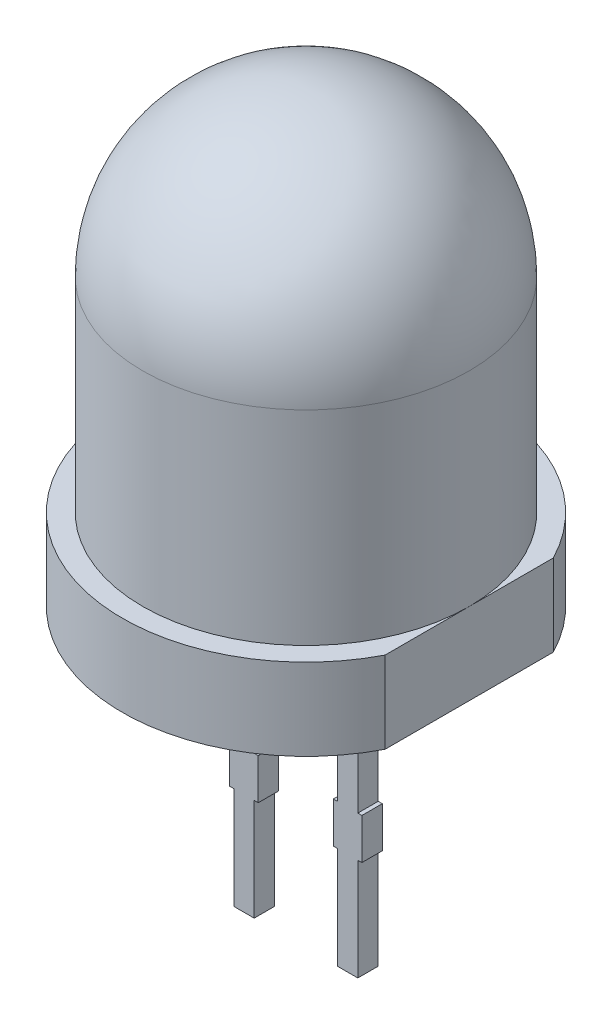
ISO-10303-21;
HEADER;
FILE_DESCRIPTION(('STEP AP214'),'2;1');
FILE_NAME('part.step','',(''),(''),'','','');
FILE_SCHEMA(('AUTOMOTIVE_DESIGN { 1 0 10303 214 1 1 1 1 }'));
ENDSEC;
DATA;
#1=APPLICATION_CONTEXT('core data for automotive mechanical design processes');
#2=APPLICATION_PROTOCOL_DEFINITION('international standard','automotive_design',2000,#1);
#3=PRODUCT_CONTEXT('',#1,'mechanical');
#4=PRODUCT('Part','Part','',(#3));
#5=PRODUCT_RELATED_PRODUCT_CATEGORY('part','',(#4));
#6=PRODUCT_DEFINITION_FORMATION('','',#4);
#7=PRODUCT_DEFINITION_CONTEXT('part definition',#1,'design');
#8=PRODUCT_DEFINITION('design','',#6,#7);
#9=PRODUCT_DEFINITION_SHAPE('','',#8);
#10=(LENGTH_UNIT() NAMED_UNIT(*) SI_UNIT(.MILLI.,.METRE.));
#11=(NAMED_UNIT(*) PLANE_ANGLE_UNIT() SI_UNIT($,.RADIAN.));
#12=(NAMED_UNIT(*) SI_UNIT($,.STERADIAN.) SOLID_ANGLE_UNIT());
#13=UNCERTAINTY_MEASURE_WITH_UNIT(LENGTH_MEASURE(1.E-05),#10,'distance_accuracy_value','');
#14=(GEOMETRIC_REPRESENTATION_CONTEXT(3) GLOBAL_UNCERTAINTY_ASSIGNED_CONTEXT((#13)) GLOBAL_UNIT_ASSIGNED_CONTEXT((#10,
#11,#12)) REPRESENTATION_CONTEXT('',''));
#15=CARTESIAN_POINT('',(0.,0.,0.));
#16=DIRECTION('',(0.,0.,1.));
#17=DIRECTION('',(1.,0.,0.));
#18=AXIS2_PLACEMENT_3D('',#15,#16,#17);
#19=CARTESIAN_POINT('',(4.5,4.5,0.));
#20=DIRECTION('',(0.,-1.,0.));
#21=DIRECTION('',(0.,0.,-1.));
#22=AXIS2_PLACEMENT_3D('',#19,#20,#21);
#23=PLANE('',#22);
#24=DIRECTION('',(-1.,0.,0.));
#25=VECTOR('',#24,1.);
#26=CARTESIAN_POINT('',(1.52,4.5,0.25));
#27=LINE('',#26,#25);
#28=CARTESIAN_POINT('',(1.52,4.5,0.25));
#29=VERTEX_POINT('',#28);
#30=CARTESIAN_POINT('',(1.02,4.5,0.25));
#31=VERTEX_POINT('',#30);
#32=EDGE_CURVE('E220',#29,#31,#27,.T.);
#33=ORIENTED_EDGE('',*,*,#32,.F.);
#34=DIRECTION('',(0.,0.,-1.));
#35=VECTOR('',#34,1.);
#36=CARTESIAN_POINT('',(1.52,4.5,0.25));
#37=LINE('',#36,#35);
#38=CARTESIAN_POINT('',(1.52,4.5,-0.25));
#39=VERTEX_POINT('',#38);
#40=EDGE_CURVE('E459',#29,#39,#37,.T.);
#41=ORIENTED_EDGE('',*,*,#40,.T.);
#42=DIRECTION('',(-1.,0.,0.));
#43=VECTOR('',#42,1.);
#44=CARTESIAN_POINT('',(1.52,4.5,-0.25));
#45=LINE('',#44,#43);
#46=CARTESIAN_POINT('',(1.02,4.5,-0.25));
#47=VERTEX_POINT('',#46);
#48=EDGE_CURVE('E235',#39,#47,#45,.T.);
#49=ORIENTED_EDGE('',*,*,#48,.T.);
#50=DIRECTION('',(0.,0.,-1.));
#51=VECTOR('',#50,1.);
#52=CARTESIAN_POINT('',(1.02,4.5,0.25));
#53=LINE('',#52,#51);
#54=EDGE_CURVE('E52',#31,#47,#53,.T.);
#55=ORIENTED_EDGE('',*,*,#54,.F.);
#56=EDGE_LOOP('',(#33,#41,#49,#55));
#57=FACE_BOUND('',#56,.T.);
#58=DIRECTION('',(0.,0.,1.));
#59=VECTOR('',#58,1.);
#60=CARTESIAN_POINT('',(4.,4.5,-2.06155281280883));
#61=LINE('',#60,#59);
#62=CARTESIAN_POINT('',(4.,4.5,-2.06155281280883));
#63=VERTEX_POINT('',#62);
#64=CARTESIAN_POINT('',(4.,4.5,2.06155281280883));
#65=VERTEX_POINT('',#64);
#66=EDGE_CURVE('E373',#63,#65,#61,.T.);
#67=ORIENTED_EDGE('',*,*,#66,.T.);
#68=CARTESIAN_POINT('',(0.,4.5,0.));
#69=DIRECTION('',(0.,-1.,0.));
#70=DIRECTION('',(0.,0.,-1.));
#71=AXIS2_PLACEMENT_3D('',#68,#69,#70);
#72=CIRCLE('',#71,4.5);
#73=EDGE_CURVE('E379',#65,#63,#72,.T.);
#74=ORIENTED_EDGE('',*,*,#73,.T.);
#75=EDGE_LOOP('',(#67,#74));
#76=FACE_BOUND('',#75,.T.);
#77=DIRECTION('',(0.,0.,-1.));
#78=VECTOR('',#77,1.);
#79=CARTESIAN_POINT('',(-1.52,4.5,0.25));
#80=LINE('',#79,#78);
#81=CARTESIAN_POINT('',(-1.52,4.5,0.25));
#82=VERTEX_POINT('',#81);
#83=CARTESIAN_POINT('',(-1.52,4.5,-0.25));
#84=VERTEX_POINT('',#83);
#85=EDGE_CURVE('E60',#82,#84,#80,.T.);
#86=ORIENTED_EDGE('',*,*,#85,.F.);
#87=DIRECTION('',(-1.,0.,0.));
#88=VECTOR('',#87,1.);
#89=CARTESIAN_POINT('',(-1.52,4.5,0.25));
#90=LINE('',#89,#88);
#91=CARTESIAN_POINT('',(-1.02,4.5,0.25));
#92=VERTEX_POINT('',#91);
#93=EDGE_CURVE('E248',#92,#82,#90,.T.);
#94=ORIENTED_EDGE('',*,*,#93,.F.);
#95=DIRECTION('',(0.,0.,-1.));
#96=VECTOR('',#95,1.);
#97=CARTESIAN_POINT('',(-1.02,4.5,0.25));
#98=LINE('',#97,#96);
#99=CARTESIAN_POINT('',(-1.02,4.5,-0.25));
#100=VERTEX_POINT('',#99);
#101=EDGE_CURVE('E286',#92,#100,#98,.T.);
#102=ORIENTED_EDGE('',*,*,#101,.T.);
#103=DIRECTION('',(-1.,0.,0.));
#104=VECTOR('',#103,1.);
#105=CARTESIAN_POINT('',(-1.52,4.5,-0.25));
#106=LINE('',#105,#104);
#107=EDGE_CURVE('E237',#100,#84,#106,.T.);
#108=ORIENTED_EDGE('',*,*,#107,.T.);
#109=EDGE_LOOP('',(#86,#94,#102,#108));
#110=FACE_BOUND('',#109,.T.);
#111=ADVANCED_FACE('F36',(#57,#76,#110),#23,.T.);
#112=CARTESIAN_POINT('',(0.,11.5,0.));
#113=DIRECTION('',(0.,-1.,0.));
#114=DIRECTION('',(1.,0.,0.));
#115=AXIS2_PLACEMENT_3D('',#112,#113,#114);
#116=SPHERICAL_SURFACE('',#115,4.);
#117=CARTESIAN_POINT('',(0.,11.5,0.));
#118=DIRECTION('',(0.,-1.,0.));
#119=DIRECTION('',(0.,0.,-1.));
#120=AXIS2_PLACEMENT_3D('',#117,#118,#119);
#121=CIRCLE('',#120,4.);
#122=CARTESIAN_POINT('',(0.,11.5,-4.));
#123=VERTEX_POINT('',#122);
#124=EDGE_CURVE('E11',#123,#123,#121,.T.);
#125=ORIENTED_EDGE('',*,*,#124,.F.);
#126=EDGE_LOOP('',(#125));
#127=FACE_BOUND('',#126,.T.);
#128=ADVANCED_FACE('F38',(#127),#116,.T.);
#129=CARTESIAN_POINT('',(0.,4.5,0.));
#130=DIRECTION('',(0.,-1.,0.));
#131=DIRECTION('',(0.,0.,-1.));
#132=AXIS2_PLACEMENT_3D('',#129,#130,#131);
#133=CYLINDRICAL_SURFACE('',#132,4.);
#134=ORIENTED_EDGE('',*,*,#124,.T.);
#135=EDGE_LOOP('',(#134));
#136=FACE_BOUND('',#135,.T.);
#137=CARTESIAN_POINT('',(0.,6.5,0.));
#138=DIRECTION('',(0.,-1.,0.));
#139=DIRECTION('',(0.,0.,-1.));
#140=AXIS2_PLACEMENT_3D('',#137,#138,#139);
#141=CIRCLE('',#140,4.);
#142=CARTESIAN_POINT('',(4.,6.5,0.));
#143=VERTEX_POINT('',#142);
#144=EDGE_CURVE('E45',#143,#143,#141,.T.);
#145=ORIENTED_EDGE('',*,*,#144,.F.);
#146=EDGE_LOOP('',(#145));
#147=FACE_BOUND('',#146,.T.);
#148=ADVANCED_FACE('F396',(#136,#147),#133,.T.);
#149=CARTESIAN_POINT('',(4.,6.5,0.));
#150=DIRECTION('',(0.,1.,0.));
#151=DIRECTION('',(0.,0.,1.));
#152=AXIS2_PLACEMENT_3D('',#149,#150,#151);
#153=PLANE('',#152);
#154=DIRECTION('',(0.,0.,1.));
#155=VECTOR('',#154,1.);
#156=CARTESIAN_POINT('',(4.,6.5,-2.06155281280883));
#157=LINE('',#156,#155);
#158=CARTESIAN_POINT('',(4.,6.5,-2.06155281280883));
#159=VERTEX_POINT('',#158);
#160=EDGE_CURVE('E365',#159,#143,#157,.T.);
#161=ORIENTED_EDGE('',*,*,#160,.F.);
#162=CARTESIAN_POINT('',(0.,6.5,0.));
#163=DIRECTION('',(0.,-1.,0.));
#164=DIRECTION('',(0.,0.,-1.));
#165=AXIS2_PLACEMENT_3D('',#162,#163,#164);
#166=CIRCLE('',#165,4.5);
#167=CARTESIAN_POINT('',(4.,6.5,2.06155281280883));
#168=VERTEX_POINT('',#167);
#169=EDGE_CURVE('E383',#168,#159,#166,.T.);
#170=ORIENTED_EDGE('',*,*,#169,.F.);
#171=EDGE_CURVE('E364',#143,#168,#157,.T.);
#172=ORIENTED_EDGE('',*,*,#171,.F.);
#173=ORIENTED_EDGE('',*,*,#144,.T.);
#174=EDGE_LOOP('',(#161,#170,#172,#173));
#175=FACE_BOUND('',#174,.T.);
#176=ADVANCED_FACE('F393',(#175),#153,.T.);
#177=CARTESIAN_POINT('',(0.,4.5,0.));
#178=DIRECTION('',(0.,-1.,0.));
#179=DIRECTION('',(0.,0.,-1.));
#180=AXIS2_PLACEMENT_3D('',#177,#178,#179);
#181=CYLINDRICAL_SURFACE('',#180,4.5);
#182=DIRECTION('',(0.,1.,0.));
#183=VECTOR('',#182,1.);
#184=CARTESIAN_POINT('',(4.,4.499,-2.06155281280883));
#185=LINE('',#184,#183);
#186=EDGE_CURVE('E368',#63,#159,#185,.T.);
#187=ORIENTED_EDGE('',*,*,#186,.F.);
#188=ORIENTED_EDGE('',*,*,#73,.F.);
#189=DIRECTION('',(0.,1.,0.));
#190=VECTOR('',#189,1.);
#191=CARTESIAN_POINT('',(4.,4.499,2.06155281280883));
#192=LINE('',#191,#190);
#193=EDGE_CURVE('E369',#65,#168,#192,.T.);
#194=ORIENTED_EDGE('',*,*,#193,.T.);
#195=ORIENTED_EDGE('',*,*,#169,.T.);
#196=EDGE_LOOP('',(#187,#188,#194,#195));
#197=FACE_BOUND('',#196,.T.);
#198=ADVANCED_FACE('F403',(#197),#181,.T.);
#199=CARTESIAN_POINT('',(4.,4.499,-2.06155281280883));
#200=DIRECTION('',(-1.,0.,0.));
#201=DIRECTION('',(0.,0.,1.));
#202=AXIS2_PLACEMENT_3D('',#199,#200,#201);
#203=PLANE('',#202);
#204=ORIENTED_EDGE('',*,*,#186,.T.);
#205=ORIENTED_EDGE('',*,*,#160,.T.);
#206=ORIENTED_EDGE('',*,*,#171,.T.);
#207=ORIENTED_EDGE('',*,*,#193,.F.);
#208=ORIENTED_EDGE('',*,*,#66,.F.);
#209=EDGE_LOOP('',(#204,#205,#206,#207,#208));
#210=FACE_BOUND('',#209,.T.);
#211=ADVANCED_FACE('F412',(#210),#203,.F.);
#212=CARTESIAN_POINT('',(-1.52,4.5,0.25));
#213=DIRECTION('',(1.,0.,0.));
#214=DIRECTION('',(0.,1.,0.));
#215=AXIS2_PLACEMENT_3D('',#212,#213,#214);
#216=PLANE('',#215);
#217=DIRECTION('',(0.,-1.,0.));
#218=VECTOR('',#217,1.);
#219=CARTESIAN_POINT('',(-1.52,4.5,-0.25));
#220=LINE('',#219,#218);
#221=CARTESIAN_POINT('',(-1.52,1.,-0.25));
#222=VERTEX_POINT('',#221);
#223=EDGE_CURVE('E241',#84,#222,#220,.T.);
#224=ORIENTED_EDGE('',*,*,#223,.T.);
#225=DIRECTION('',(0.,0.,-1.));
#226=VECTOR('',#225,1.);
#227=CARTESIAN_POINT('',(-1.52,1.,0.25));
#228=LINE('',#227,#226);
#229=CARTESIAN_POINT('',(-1.52,1.,0.25));
#230=VERTEX_POINT('',#229);
#231=EDGE_CURVE('E358',#230,#222,#228,.T.);
#232=ORIENTED_EDGE('',*,*,#231,.F.);
#233=DIRECTION('',(0.,-1.,0.));
#234=VECTOR('',#233,1.);
#235=CARTESIAN_POINT('',(-1.52,4.5,0.25));
#236=LINE('',#235,#234);
#237=EDGE_CURVE('E252',#82,#230,#236,.T.);
#238=ORIENTED_EDGE('',*,*,#237,.F.);
#239=ORIENTED_EDGE('',*,*,#85,.T.);
#240=EDGE_LOOP('',(#224,#232,#238,#239));
#241=FACE_BOUND('',#240,.T.);
#242=ADVANCED_FACE('F419',(#241),#216,.F.);
#243=CARTESIAN_POINT('',(-1.52,1.,0.25));
#244=DIRECTION('',(0.,-1.,0.));
#245=DIRECTION('',(0.,0.,-1.));
#246=AXIS2_PLACEMENT_3D('',#243,#244,#245);
#247=PLANE('',#246);
#248=DIRECTION('',(-1.,0.,0.));
#249=VECTOR('',#248,1.);
#250=CARTESIAN_POINT('',(-1.52,1.,-0.25));
#251=LINE('',#250,#249);
#252=CARTESIAN_POINT('',(-1.62,1.,-0.25));
#253=VERTEX_POINT('',#252);
#254=EDGE_CURVE('E290',#222,#253,#251,.T.);
#255=ORIENTED_EDGE('',*,*,#254,.T.);
#256=DIRECTION('',(0.,0.,-1.));
#257=VECTOR('',#256,1.);
#258=CARTESIAN_POINT('',(-1.62,1.,0.25));
#259=LINE('',#258,#257);
#260=CARTESIAN_POINT('',(-1.62,1.,0.25));
#261=VERTEX_POINT('',#260);
#262=EDGE_CURVE('E354',#261,#253,#259,.T.);
#263=ORIENTED_EDGE('',*,*,#262,.F.);
#264=DIRECTION('',(-1.,0.,0.));
#265=VECTOR('',#264,1.);
#266=CARTESIAN_POINT('',(-1.52,1.,0.25));
#267=LINE('',#266,#265);
#268=EDGE_CURVE('E256',#230,#261,#267,.T.);
#269=ORIENTED_EDGE('',*,*,#268,.F.);
#270=ORIENTED_EDGE('',*,*,#231,.T.);
#271=EDGE_LOOP('',(#255,#263,#269,#270));
#272=FACE_BOUND('',#271,.T.);
#273=ADVANCED_FACE('F630',(#272),#247,.F.);
#274=CARTESIAN_POINT('',(-1.62,1.,0.25));
#275=DIRECTION('',(1.,0.,0.));
#276=DIRECTION('',(0.,0.,-1.));
#277=AXIS2_PLACEMENT_3D('',#274,#275,#276);
#278=PLANE('',#277);
#279=DIRECTION('',(0.,-1.,0.));
#280=VECTOR('',#279,1.);
#281=CARTESIAN_POINT('',(-1.62,1.,-0.25));
#282=LINE('',#281,#280);
#283=CARTESIAN_POINT('',(-1.62,0.,-0.25));
#284=VERTEX_POINT('',#283);
#285=EDGE_CURVE('E293',#253,#284,#282,.T.);
#286=ORIENTED_EDGE('',*,*,#285,.T.);
#287=DIRECTION('',(0.,0.,-1.));
#288=VECTOR('',#287,1.);
#289=CARTESIAN_POINT('',(-1.62,0.,0.25));
#290=LINE('',#289,#288);
#291=CARTESIAN_POINT('',(-1.62,0.,0.25));
#292=VERTEX_POINT('',#291);
#293=EDGE_CURVE('E350',#292,#284,#290,.T.);
#294=ORIENTED_EDGE('',*,*,#293,.F.);
#295=DIRECTION('',(0.,-1.,0.));
#296=VECTOR('',#295,1.);
#297=CARTESIAN_POINT('',(-1.62,1.,0.25));
#298=LINE('',#297,#296);
#299=EDGE_CURVE('E259',#261,#292,#298,.T.);
#300=ORIENTED_EDGE('',*,*,#299,.F.);
#301=ORIENTED_EDGE('',*,*,#262,.T.);
#302=EDGE_LOOP('',(#286,#294,#300,#301));
#303=FACE_BOUND('',#302,.T.);
#304=ADVANCED_FACE('F626',(#303),#278,.F.);
#305=CARTESIAN_POINT('',(-1.62,0.,0.25));
#306=DIRECTION('',(0.,1.,0.));
#307=DIRECTION('',(0.,0.,1.));
#308=AXIS2_PLACEMENT_3D('',#305,#306,#307);
#309=PLANE('',#308);
#310=DIRECTION('',(1.,0.,0.));
#311=VECTOR('',#310,1.);
#312=CARTESIAN_POINT('',(-1.62,0.,-0.25));
#313=LINE('',#312,#311);
#314=CARTESIAN_POINT('',(-1.52,0.,-0.25));
#315=VERTEX_POINT('',#314);
#316=EDGE_CURVE('E296',#284,#315,#313,.T.);
#317=ORIENTED_EDGE('',*,*,#316,.T.);
#318=DIRECTION('',(0.,0.,-1.));
#319=VECTOR('',#318,1.);
#320=CARTESIAN_POINT('',(-1.52,0.,0.25));
#321=LINE('',#320,#319);
#322=CARTESIAN_POINT('',(-1.52,0.,0.25));
#323=VERTEX_POINT('',#322);
#324=EDGE_CURVE('E346',#323,#315,#321,.T.);
#325=ORIENTED_EDGE('',*,*,#324,.F.);
#326=DIRECTION('',(1.,0.,0.));
#327=VECTOR('',#326,1.);
#328=CARTESIAN_POINT('',(-1.62,0.,0.25));
#329=LINE('',#328,#327);
#330=EDGE_CURVE('E262',#292,#323,#329,.T.);
#331=ORIENTED_EDGE('',*,*,#330,.F.);
#332=ORIENTED_EDGE('',*,*,#293,.T.);
#333=EDGE_LOOP('',(#317,#325,#331,#332));
#334=FACE_BOUND('',#333,.T.);
#335=ADVANCED_FACE('F622',(#334),#309,.F.);
#336=CARTESIAN_POINT('',(-1.52,0.,0.25));
#337=DIRECTION('',(1.,0.,0.));
#338=DIRECTION('',(0.,0.,-1.));
#339=AXIS2_PLACEMENT_3D('',#336,#337,#338);
#340=PLANE('',#339);
#341=DIRECTION('',(0.,-1.,0.));
#342=VECTOR('',#341,1.);
#343=CARTESIAN_POINT('',(-1.52,0.,-0.25));
#344=LINE('',#343,#342);
#345=CARTESIAN_POINT('',(-1.52,-2.5,-0.25));
#346=VERTEX_POINT('',#345);
#347=EDGE_CURVE('E299',#315,#346,#344,.T.);
#348=ORIENTED_EDGE('',*,*,#347,.T.);
#349=DIRECTION('',(0.,0.,-1.));
#350=VECTOR('',#349,1.);
#351=CARTESIAN_POINT('',(-1.52,-2.5,0.25));
#352=LINE('',#351,#350);
#353=CARTESIAN_POINT('',(-1.52,-2.5,0.25));
#354=VERTEX_POINT('',#353);
#355=EDGE_CURVE('E342',#354,#346,#352,.T.);
#356=ORIENTED_EDGE('',*,*,#355,.F.);
#357=DIRECTION('',(0.,-1.,0.));
#358=VECTOR('',#357,1.);
#359=CARTESIAN_POINT('',(-1.52,0.,0.25));
#360=LINE('',#359,#358);
#361=EDGE_CURVE('E265',#323,#354,#360,.T.);
#362=ORIENTED_EDGE('',*,*,#361,.F.);
#363=ORIENTED_EDGE('',*,*,#324,.T.);
#364=EDGE_LOOP('',(#348,#356,#362,#363));
#365=FACE_BOUND('',#364,.T.);
#366=ADVANCED_FACE('F618',(#365),#340,.F.);
#367=CARTESIAN_POINT('',(-1.52,-2.5,0.25));
#368=DIRECTION('',(0.,1.,0.));
#369=DIRECTION('',(0.,0.,1.));
#370=AXIS2_PLACEMENT_3D('',#367,#368,#369);
#371=PLANE('',#370);
#372=DIRECTION('',(1.,0.,0.));
#373=VECTOR('',#372,1.);
#374=CARTESIAN_POINT('',(-1.52,-2.5,-0.25));
#375=LINE('',#374,#373);
#376=CARTESIAN_POINT('',(-1.02,-2.5,-0.25));
#377=VERTEX_POINT('',#376);
#378=EDGE_CURVE('E302',#346,#377,#375,.T.);
#379=ORIENTED_EDGE('',*,*,#378,.T.);
#380=DIRECTION('',(0.,0.,-1.));
#381=VECTOR('',#380,1.);
#382=CARTESIAN_POINT('',(-1.02,-2.5,0.25));
#383=LINE('',#382,#381);
#384=CARTESIAN_POINT('',(-1.02,-2.5,0.25));
#385=VERTEX_POINT('',#384);
#386=EDGE_CURVE('E338',#385,#377,#383,.T.);
#387=ORIENTED_EDGE('',*,*,#386,.F.);
#388=DIRECTION('',(1.,0.,0.));
#389=VECTOR('',#388,1.);
#390=CARTESIAN_POINT('',(-1.52,-2.5,0.25));
#391=LINE('',#390,#389);
#392=EDGE_CURVE('E268',#354,#385,#391,.T.);
#393=ORIENTED_EDGE('',*,*,#392,.F.);
#394=ORIENTED_EDGE('',*,*,#355,.T.);
#395=EDGE_LOOP('',(#379,#387,#393,#394));
#396=FACE_BOUND('',#395,.T.);
#397=ADVANCED_FACE('F614',(#396),#371,.F.);
#398=CARTESIAN_POINT('',(-1.02,0.,0.25));
#399=DIRECTION('',(-1.,0.,0.));
#400=DIRECTION('',(0.,-1.,0.));
#401=AXIS2_PLACEMENT_3D('',#398,#399,#400);
#402=PLANE('',#401);
#403=DIRECTION('',(0.,1.,0.));
#404=VECTOR('',#403,1.);
#405=CARTESIAN_POINT('',(-1.02,0.,-0.25));
#406=LINE('',#405,#404);
#407=CARTESIAN_POINT('',(-1.02,0.,-0.25));
#408=VERTEX_POINT('',#407);
#409=EDGE_CURVE('E305',#377,#408,#406,.T.);
#410=ORIENTED_EDGE('',*,*,#409,.T.);
#411=DIRECTION('',(0.,0.,-1.));
#412=VECTOR('',#411,1.);
#413=CARTESIAN_POINT('',(-1.02,0.,0.25));
#414=LINE('',#413,#412);
#415=CARTESIAN_POINT('',(-1.02,0.,0.25));
#416=VERTEX_POINT('',#415);
#417=EDGE_CURVE('E334',#416,#408,#414,.T.);
#418=ORIENTED_EDGE('',*,*,#417,.F.);
#419=DIRECTION('',(0.,1.,0.));
#420=VECTOR('',#419,1.);
#421=CARTESIAN_POINT('',(-1.02,0.,0.25));
#422=LINE('',#421,#420);
#423=EDGE_CURVE('E271',#385,#416,#422,.T.);
#424=ORIENTED_EDGE('',*,*,#423,.F.);
#425=ORIENTED_EDGE('',*,*,#386,.T.);
#426=EDGE_LOOP('',(#410,#418,#424,#425));
#427=FACE_BOUND('',#426,.T.);
#428=ADVANCED_FACE('F610',(#427),#402,.F.);
#429=CARTESIAN_POINT('',(-0.919999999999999,0.,0.25));
#430=DIRECTION('',(0.,1.,0.));
#431=DIRECTION('',(-1.,0.,0.));
#432=AXIS2_PLACEMENT_3D('',#429,#430,#431);
#433=PLANE('',#432);
#434=DIRECTION('',(1.,0.,0.));
#435=VECTOR('',#434,1.);
#436=CARTESIAN_POINT('',(-0.919999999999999,0.,-0.25));
#437=LINE('',#436,#435);
#438=CARTESIAN_POINT('',(-0.919999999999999,0.,-0.25));
#439=VERTEX_POINT('',#438);
#440=EDGE_CURVE('E308',#408,#439,#437,.T.);
#441=ORIENTED_EDGE('',*,*,#440,.T.);
#442=DIRECTION('',(0.,0.,-1.));
#443=VECTOR('',#442,1.);
#444=CARTESIAN_POINT('',(-0.919999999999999,0.,0.25));
#445=LINE('',#444,#443);
#446=CARTESIAN_POINT('',(-0.919999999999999,0.,0.25));
#447=VERTEX_POINT('',#446);
#448=EDGE_CURVE('E330',#447,#439,#445,.T.);
#449=ORIENTED_EDGE('',*,*,#448,.F.);
#450=DIRECTION('',(1.,0.,0.));
#451=VECTOR('',#450,1.);
#452=CARTESIAN_POINT('',(-0.919999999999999,0.,0.25));
#453=LINE('',#452,#451);
#454=EDGE_CURVE('E274',#416,#447,#453,.T.);
#455=ORIENTED_EDGE('',*,*,#454,.F.);
#456=ORIENTED_EDGE('',*,*,#417,.T.);
#457=EDGE_LOOP('',(#441,#449,#455,#456));
#458=FACE_BOUND('',#457,.T.);
#459=ADVANCED_FACE('F606',(#458),#433,.F.);
#460=CARTESIAN_POINT('',(-0.920000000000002,1.,0.25));
#461=DIRECTION('',(-1.,0.,0.));
#462=DIRECTION('',(0.,-1.,0.));
#463=AXIS2_PLACEMENT_3D('',#460,#461,#462);
#464=PLANE('',#463);
#465=DIRECTION('',(0.,1.,0.));
#466=VECTOR('',#465,1.);
#467=CARTESIAN_POINT('',(-0.920000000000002,1.,-0.25));
#468=LINE('',#467,#466);
#469=CARTESIAN_POINT('',(-0.920000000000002,1.,-0.25));
#470=VERTEX_POINT('',#469);
#471=EDGE_CURVE('E311',#439,#470,#468,.T.);
#472=ORIENTED_EDGE('',*,*,#471,.T.);
#473=DIRECTION('',(0.,0.,-1.));
#474=VECTOR('',#473,1.);
#475=CARTESIAN_POINT('',(-0.920000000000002,1.,0.25));
#476=LINE('',#475,#474);
#477=CARTESIAN_POINT('',(-0.920000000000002,1.,0.25));
#478=VERTEX_POINT('',#477);
#479=EDGE_CURVE('E326',#478,#470,#476,.T.);
#480=ORIENTED_EDGE('',*,*,#479,.F.);
#481=DIRECTION('',(0.,1.,0.));
#482=VECTOR('',#481,1.);
#483=CARTESIAN_POINT('',(-0.920000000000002,1.,0.25));
#484=LINE('',#483,#482);
#485=EDGE_CURVE('E277',#447,#478,#484,.T.);
#486=ORIENTED_EDGE('',*,*,#485,.F.);
#487=ORIENTED_EDGE('',*,*,#448,.T.);
#488=EDGE_LOOP('',(#472,#480,#486,#487));
#489=FACE_BOUND('',#488,.T.);
#490=ADVANCED_FACE('F602',(#489),#464,.F.);
#491=CARTESIAN_POINT('',(-1.02,1.,0.25));
#492=DIRECTION('',(0.,-1.,0.));
#493=DIRECTION('',(0.,0.,-1.));
#494=AXIS2_PLACEMENT_3D('',#491,#492,#493);
#495=PLANE('',#494);
#496=DIRECTION('',(-1.,0.,0.));
#497=VECTOR('',#496,1.);
#498=CARTESIAN_POINT('',(-1.02,1.,-0.25));
#499=LINE('',#498,#497);
#500=CARTESIAN_POINT('',(-1.02,1.,-0.25));
#501=VERTEX_POINT('',#500);
#502=EDGE_CURVE('E314',#470,#501,#499,.T.);
#503=ORIENTED_EDGE('',*,*,#502,.T.);
#504=DIRECTION('',(0.,0.,-1.));
#505=VECTOR('',#504,1.);
#506=CARTESIAN_POINT('',(-1.02,1.,0.25));
#507=LINE('',#506,#505);
#508=CARTESIAN_POINT('',(-1.02,1.,0.25));
#509=VERTEX_POINT('',#508);
#510=EDGE_CURVE('E322',#509,#501,#507,.T.);
#511=ORIENTED_EDGE('',*,*,#510,.F.);
#512=DIRECTION('',(-1.,0.,0.));
#513=VECTOR('',#512,1.);
#514=CARTESIAN_POINT('',(-1.02,1.,0.25));
#515=LINE('',#514,#513);
#516=EDGE_CURVE('E280',#478,#509,#515,.T.);
#517=ORIENTED_EDGE('',*,*,#516,.F.);
#518=ORIENTED_EDGE('',*,*,#479,.T.);
#519=EDGE_LOOP('',(#503,#511,#517,#518));
#520=FACE_BOUND('',#519,.T.);
#521=ADVANCED_FACE('F598',(#520),#495,.F.);
#522=CARTESIAN_POINT('',(-1.02,4.5,0.25));
#523=DIRECTION('',(-1.,0.,0.));
#524=DIRECTION('',(0.,-1.,0.));
#525=AXIS2_PLACEMENT_3D('',#522,#523,#524);
#526=PLANE('',#525);
#527=DIRECTION('',(0.,1.,0.));
#528=VECTOR('',#527,1.);
#529=CARTESIAN_POINT('',(-1.02,4.5,-0.25));
#530=LINE('',#529,#528);
#531=EDGE_CURVE('E253',#501,#100,#530,.T.);
#532=ORIENTED_EDGE('',*,*,#531,.T.);
#533=ORIENTED_EDGE('',*,*,#101,.F.);
#534=DIRECTION('',(0.,1.,0.));
#535=VECTOR('',#534,1.);
#536=CARTESIAN_POINT('',(-1.02,4.5,0.25));
#537=LINE('',#536,#535);
#538=EDGE_CURVE('E283',#509,#92,#537,.T.);
#539=ORIENTED_EDGE('',*,*,#538,.F.);
#540=ORIENTED_EDGE('',*,*,#510,.T.);
#541=EDGE_LOOP('',(#532,#533,#539,#540));
#542=FACE_BOUND('',#541,.T.);
#543=ADVANCED_FACE('F591',(#542),#526,.F.);
#544=CARTESIAN_POINT('',(-1.52,4.5,0.25));
#545=DIRECTION('',(0.,0.,-1.));
#546=DIRECTION('',(-1.,0.,0.));
#547=AXIS2_PLACEMENT_3D('',#544,#545,#546);
#548=PLANE('',#547);
#549=ORIENTED_EDGE('',*,*,#93,.T.);
#550=ORIENTED_EDGE('',*,*,#237,.T.);
#551=ORIENTED_EDGE('',*,*,#268,.T.);
#552=ORIENTED_EDGE('',*,*,#299,.T.);
#553=ORIENTED_EDGE('',*,*,#330,.T.);
#554=ORIENTED_EDGE('',*,*,#361,.T.);
#555=ORIENTED_EDGE('',*,*,#392,.T.);
#556=ORIENTED_EDGE('',*,*,#423,.T.);
#557=ORIENTED_EDGE('',*,*,#454,.T.);
#558=ORIENTED_EDGE('',*,*,#485,.T.);
#559=ORIENTED_EDGE('',*,*,#516,.T.);
#560=ORIENTED_EDGE('',*,*,#538,.T.);
#561=EDGE_LOOP('',(#549,#550,#551,#552,#553,#554,#555,#556,#557,#558,#559,#560));
#562=FACE_BOUND('',#561,.T.);
#563=ADVANCED_FACE('F588',(#562),#548,.F.);
#564=CARTESIAN_POINT('',(-1.52,4.5,-0.25));
#565=DIRECTION('',(0.,0.,-1.));
#566=DIRECTION('',(-1.,0.,0.));
#567=AXIS2_PLACEMENT_3D('',#564,#565,#566);
#568=PLANE('',#567);
#569=ORIENTED_EDGE('',*,*,#107,.F.);
#570=ORIENTED_EDGE('',*,*,#531,.F.);
#571=ORIENTED_EDGE('',*,*,#502,.F.);
#572=ORIENTED_EDGE('',*,*,#471,.F.);
#573=ORIENTED_EDGE('',*,*,#440,.F.);
#574=ORIENTED_EDGE('',*,*,#409,.F.);
#575=ORIENTED_EDGE('',*,*,#378,.F.);
#576=ORIENTED_EDGE('',*,*,#347,.F.);
#577=ORIENTED_EDGE('',*,*,#316,.F.);
#578=ORIENTED_EDGE('',*,*,#285,.F.);
#579=ORIENTED_EDGE('',*,*,#254,.F.);
#580=ORIENTED_EDGE('',*,*,#223,.F.);
#581=EDGE_LOOP('',(#569,#570,#571,#572,#573,#574,#575,#576,#577,#578,#579,#580));
#582=FACE_BOUND('',#581,.T.);
#583=ADVANCED_FACE('F587',(#582),#568,.T.);
#584=CARTESIAN_POINT('',(1.02,4.5,0.25));
#585=DIRECTION('',(1.,0.,0.));
#586=DIRECTION('',(0.,1.,0.));
#587=AXIS2_PLACEMENT_3D('',#584,#585,#586);
#588=PLANE('',#587);
#589=DIRECTION('',(0.,-1.,0.));
#590=VECTOR('',#589,1.);
#591=CARTESIAN_POINT('',(1.02,4.5,-0.25));
#592=LINE('',#591,#590);
#593=CARTESIAN_POINT('',(1.02,1.,-0.25));
#594=VERTEX_POINT('',#593);
#595=EDGE_CURVE('E436',#47,#594,#592,.T.);
#596=ORIENTED_EDGE('',*,*,#595,.T.);
#597=DIRECTION('',(0.,0.,-1.));
#598=VECTOR('',#597,1.);
#599=CARTESIAN_POINT('',(1.02,1.,0.25));
#600=LINE('',#599,#598);
#601=CARTESIAN_POINT('',(1.02,1.,0.25));
#602=VERTEX_POINT('',#601);
#603=EDGE_CURVE('E215',#602,#594,#600,.T.);
#604=ORIENTED_EDGE('',*,*,#603,.F.);
#605=DIRECTION('',(0.,-1.,0.));
#606=VECTOR('',#605,1.);
#607=CARTESIAN_POINT('',(1.02,4.5,0.25));
#608=LINE('',#607,#606);
#609=EDGE_CURVE('E211',#31,#602,#608,.T.);
#610=ORIENTED_EDGE('',*,*,#609,.F.);
#611=ORIENTED_EDGE('',*,*,#54,.T.);
#612=EDGE_LOOP('',(#596,#604,#610,#611));
#613=FACE_BOUND('',#612,.T.);
#614=ADVANCED_FACE('F213',(#613),#588,.F.);
#615=CARTESIAN_POINT('',(1.02,1.,0.25));
#616=DIRECTION('',(0.,-1.,0.));
#617=DIRECTION('',(0.,0.,-1.));
#618=AXIS2_PLACEMENT_3D('',#615,#616,#617);
#619=PLANE('',#618);
#620=DIRECTION('',(-1.,0.,0.));
#621=VECTOR('',#620,1.);
#622=CARTESIAN_POINT('',(1.02,1.,-0.25));
#623=LINE('',#622,#621);
#624=CARTESIAN_POINT('',(0.920000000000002,1.,-0.25));
#625=VERTEX_POINT('',#624);
#626=EDGE_CURVE('E448',#594,#625,#623,.T.);
#627=ORIENTED_EDGE('',*,*,#626,.T.);
#628=DIRECTION('',(0.,0.,-1.));
#629=VECTOR('',#628,1.);
#630=CARTESIAN_POINT('',(0.920000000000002,1.,0.25));
#631=LINE('',#630,#629);
#632=CARTESIAN_POINT('',(0.920000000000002,1.,0.25));
#633=VERTEX_POINT('',#632);
#634=EDGE_CURVE('E244',#633,#625,#631,.T.);
#635=ORIENTED_EDGE('',*,*,#634,.F.);
#636=DIRECTION('',(-1.,0.,0.));
#637=VECTOR('',#636,1.);
#638=CARTESIAN_POINT('',(1.02,1.,0.25));
#639=LINE('',#638,#637);
#640=EDGE_CURVE('E219',#602,#633,#639,.T.);
#641=ORIENTED_EDGE('',*,*,#640,.F.);
#642=ORIENTED_EDGE('',*,*,#603,.T.);
#643=EDGE_LOOP('',(#627,#635,#641,#642));
#644=FACE_BOUND('',#643,.T.);
#645=ADVANCED_FACE('F581',(#644),#619,.F.);
#646=CARTESIAN_POINT('',(0.920000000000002,1.,0.25));
#647=DIRECTION('',(1.,0.,0.));
#648=DIRECTION('',(0.,1.,0.));
#649=AXIS2_PLACEMENT_3D('',#646,#647,#648);
#650=PLANE('',#649);
#651=DIRECTION('',(0.,-1.,0.));
#652=VECTOR('',#651,1.);
#653=CARTESIAN_POINT('',(0.920000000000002,1.,-0.25));
#654=LINE('',#653,#652);
#655=CARTESIAN_POINT('',(0.919999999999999,0.,-0.25));
#656=VERTEX_POINT('',#655);
#657=EDGE_CURVE('E441',#625,#656,#654,.T.);
#658=ORIENTED_EDGE('',*,*,#657,.T.);
#659=DIRECTION('',(0.,0.,-1.));
#660=VECTOR('',#659,1.);
#661=CARTESIAN_POINT('',(0.919999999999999,0.,0.25));
#662=LINE('',#661,#660);
#663=CARTESIAN_POINT('',(0.919999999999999,0.,0.25));
#664=VERTEX_POINT('',#663);
#665=EDGE_CURVE('E426',#664,#656,#662,.T.);
#666=ORIENTED_EDGE('',*,*,#665,.F.);
#667=DIRECTION('',(0.,-1.,0.));
#668=VECTOR('',#667,1.);
#669=CARTESIAN_POINT('',(0.920000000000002,1.,0.25));
#670=LINE('',#669,#668);
#671=EDGE_CURVE('E462',#633,#664,#670,.T.);
#672=ORIENTED_EDGE('',*,*,#671,.F.);
#673=ORIENTED_EDGE('',*,*,#634,.T.);
#674=EDGE_LOOP('',(#658,#666,#672,#673));
#675=FACE_BOUND('',#674,.T.);
#676=ADVANCED_FACE('F541',(#675),#650,.F.);
#677=CARTESIAN_POINT('',(0.919999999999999,0.,0.25));
#678=DIRECTION('',(0.,1.,0.));
#679=DIRECTION('',(-1.,0.,0.));
#680=AXIS2_PLACEMENT_3D('',#677,#678,#679);
#681=PLANE('',#680);
#682=DIRECTION('',(1.,0.,0.));
#683=VECTOR('',#682,1.);
#684=CARTESIAN_POINT('',(0.919999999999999,0.,-0.25));
#685=LINE('',#684,#683);
#686=CARTESIAN_POINT('',(1.02,0.,-0.25));
#687=VERTEX_POINT('',#686);
#688=EDGE_CURVE('E439',#656,#687,#685,.T.);
#689=ORIENTED_EDGE('',*,*,#688,.T.);
#690=DIRECTION('',(0.,0.,-1.));
#691=VECTOR('',#690,1.);
#692=CARTESIAN_POINT('',(1.02,0.,0.25));
#693=LINE('',#692,#691);
#694=CARTESIAN_POINT('',(1.02,0.,0.25));
#695=VERTEX_POINT('',#694);
#696=EDGE_CURVE('E479',#695,#687,#693,.T.);
#697=ORIENTED_EDGE('',*,*,#696,.F.);
#698=DIRECTION('',(1.,0.,0.));
#699=VECTOR('',#698,1.);
#700=CARTESIAN_POINT('',(0.919999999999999,0.,0.25));
#701=LINE('',#700,#699);
#702=EDGE_CURVE('E457',#664,#695,#701,.T.);
#703=ORIENTED_EDGE('',*,*,#702,.F.);
#704=ORIENTED_EDGE('',*,*,#665,.T.);
#705=EDGE_LOOP('',(#689,#697,#703,#704));
#706=FACE_BOUND('',#705,.T.);
#707=ADVANCED_FACE('F544',(#706),#681,.F.);
#708=CARTESIAN_POINT('',(1.02,0.,0.25));
#709=DIRECTION('',(1.,0.,0.));
#710=DIRECTION('',(0.,1.,0.));
#711=AXIS2_PLACEMENT_3D('',#708,#709,#710);
#712=PLANE('',#711);
#713=DIRECTION('',(0.,-1.,0.));
#714=VECTOR('',#713,1.);
#715=CARTESIAN_POINT('',(1.02,0.,-0.25));
#716=LINE('',#715,#714);
#717=CARTESIAN_POINT('',(1.02,-2.5,-0.25));
#718=VERTEX_POINT('',#717);
#719=EDGE_CURVE('E434',#687,#718,#716,.T.);
#720=ORIENTED_EDGE('',*,*,#719,.T.);
#721=DIRECTION('',(0.,0.,-1.));
#722=VECTOR('',#721,1.);
#723=CARTESIAN_POINT('',(1.02,-2.5,0.25));
#724=LINE('',#723,#722);
#725=CARTESIAN_POINT('',(1.02,-2.5,0.25));
#726=VERTEX_POINT('',#725);
#727=EDGE_CURVE('E476',#726,#718,#724,.T.);
#728=ORIENTED_EDGE('',*,*,#727,.F.);
#729=DIRECTION('',(0.,-1.,0.));
#730=VECTOR('',#729,1.);
#731=CARTESIAN_POINT('',(1.02,0.,0.25));
#732=LINE('',#731,#730);
#733=EDGE_CURVE('E455',#695,#726,#732,.T.);
#734=ORIENTED_EDGE('',*,*,#733,.F.);
#735=ORIENTED_EDGE('',*,*,#696,.T.);
#736=EDGE_LOOP('',(#720,#728,#734,#735));
#737=FACE_BOUND('',#736,.T.);
#738=ADVANCED_FACE('F507',(#737),#712,.F.);
#739=CARTESIAN_POINT('',(1.52,-2.5,0.25));
#740=DIRECTION('',(0.,1.,0.));
#741=DIRECTION('',(0.,0.,1.));
#742=AXIS2_PLACEMENT_3D('',#739,#740,#741);
#743=PLANE('',#742);
#744=DIRECTION('',(1.,0.,0.));
#745=VECTOR('',#744,1.);
#746=CARTESIAN_POINT('',(1.52,-2.5,-0.25));
#747=LINE('',#746,#745);
#748=CARTESIAN_POINT('',(1.52,-2.5,-0.25));
#749=VERTEX_POINT('',#748);
#750=EDGE_CURVE('E432',#718,#749,#747,.T.);
#751=ORIENTED_EDGE('',*,*,#750,.T.);
#752=DIRECTION('',(0.,0.,-1.));
#753=VECTOR('',#752,1.);
#754=CARTESIAN_POINT('',(1.52,-2.5,0.25));
#755=LINE('',#754,#753);
#756=CARTESIAN_POINT('',(1.52,-2.5,0.25));
#757=VERTEX_POINT('',#756);
#758=EDGE_CURVE('E473',#757,#749,#755,.T.);
#759=ORIENTED_EDGE('',*,*,#758,.F.);
#760=DIRECTION('',(1.,0.,0.));
#761=VECTOR('',#760,1.);
#762=CARTESIAN_POINT('',(1.52,-2.5,0.25));
#763=LINE('',#762,#761);
#764=EDGE_CURVE('E452',#726,#757,#763,.T.);
#765=ORIENTED_EDGE('',*,*,#764,.F.);
#766=ORIENTED_EDGE('',*,*,#727,.T.);
#767=EDGE_LOOP('',(#751,#759,#765,#766));
#768=FACE_BOUND('',#767,.T.);
#769=ADVANCED_FACE('F566',(#768),#743,.F.);
#770=CARTESIAN_POINT('',(1.52,0.,0.25));
#771=DIRECTION('',(-1.,0.,0.));
#772=DIRECTION('',(0.,-1.,0.));
#773=AXIS2_PLACEMENT_3D('',#770,#771,#772);
#774=PLANE('',#773);
#775=DIRECTION('',(0.,1.,0.));
#776=VECTOR('',#775,1.);
#777=CARTESIAN_POINT('',(1.52,0.,-0.25));
#778=LINE('',#777,#776);
#779=CARTESIAN_POINT('',(1.52,0.,-0.25));
#780=VERTEX_POINT('',#779);
#781=EDGE_CURVE('E429',#749,#780,#778,.T.);
#782=ORIENTED_EDGE('',*,*,#781,.T.);
#783=DIRECTION('',(0.,0.,-1.));
#784=VECTOR('',#783,1.);
#785=CARTESIAN_POINT('',(1.52,0.,0.25));
#786=LINE('',#785,#784);
#787=CARTESIAN_POINT('',(1.52,0.,0.25));
#788=VERTEX_POINT('',#787);
#789=EDGE_CURVE('E471',#788,#780,#786,.T.);
#790=ORIENTED_EDGE('',*,*,#789,.F.);
#791=DIRECTION('',(0.,1.,0.));
#792=VECTOR('',#791,1.);
#793=CARTESIAN_POINT('',(1.52,0.,0.25));
#794=LINE('',#793,#792);
#795=EDGE_CURVE('E451',#757,#788,#794,.T.);
#796=ORIENTED_EDGE('',*,*,#795,.F.);
#797=ORIENTED_EDGE('',*,*,#758,.T.);
#798=EDGE_LOOP('',(#782,#790,#796,#797));
#799=FACE_BOUND('',#798,.T.);
#800=ADVANCED_FACE('F562',(#799),#774,.F.);
#801=CARTESIAN_POINT('',(1.62,0.,0.25));
#802=DIRECTION('',(0.,1.,0.));
#803=DIRECTION('',(-1.,0.,0.));
#804=AXIS2_PLACEMENT_3D('',#801,#802,#803);
#805=PLANE('',#804);
#806=DIRECTION('',(1.,0.,0.));
#807=VECTOR('',#806,1.);
#808=CARTESIAN_POINT('',(1.62,0.,-0.25));
#809=LINE('',#808,#807);
#810=CARTESIAN_POINT('',(1.62,0.,-0.25));
#811=VERTEX_POINT('',#810);
#812=EDGE_CURVE('E427',#780,#811,#809,.T.);
#813=ORIENTED_EDGE('',*,*,#812,.T.);
#814=DIRECTION('',(0.,0.,-1.));
#815=VECTOR('',#814,1.);
#816=CARTESIAN_POINT('',(1.62,0.,0.25));
#817=LINE('',#816,#815);
#818=CARTESIAN_POINT('',(1.62,0.,0.25));
#819=VERTEX_POINT('',#818);
#820=EDGE_CURVE('E467',#819,#811,#817,.T.);
#821=ORIENTED_EDGE('',*,*,#820,.F.);
#822=DIRECTION('',(1.,0.,0.));
#823=VECTOR('',#822,1.);
#824=CARTESIAN_POINT('',(1.62,0.,0.25));
#825=LINE('',#824,#823);
#826=EDGE_CURVE('E445',#788,#819,#825,.T.);
#827=ORIENTED_EDGE('',*,*,#826,.F.);
#828=ORIENTED_EDGE('',*,*,#789,.T.);
#829=EDGE_LOOP('',(#813,#821,#827,#828));
#830=FACE_BOUND('',#829,.T.);
#831=ADVANCED_FACE('F558',(#830),#805,.F.);
#832=CARTESIAN_POINT('',(1.62,1.,0.25));
#833=DIRECTION('',(-1.,0.,0.));
#834=DIRECTION('',(0.,-1.,0.));
#835=AXIS2_PLACEMENT_3D('',#832,#833,#834);
#836=PLANE('',#835);
#837=DIRECTION('',(0.,1.,0.));
#838=VECTOR('',#837,1.);
#839=CARTESIAN_POINT('',(1.62,1.,-0.25));
#840=LINE('',#839,#838);
#841=CARTESIAN_POINT('',(1.62,1.,-0.25));
#842=VERTEX_POINT('',#841);
#843=EDGE_CURVE('E428',#811,#842,#840,.T.);
#844=ORIENTED_EDGE('',*,*,#843,.T.);
#845=DIRECTION('',(0.,0.,-1.));
#846=VECTOR('',#845,1.);
#847=CARTESIAN_POINT('',(1.62,1.,0.25));
#848=LINE('',#847,#846);
#849=CARTESIAN_POINT('',(1.62,1.,0.25));
#850=VERTEX_POINT('',#849);
#851=EDGE_CURVE('E465',#850,#842,#848,.T.);
#852=ORIENTED_EDGE('',*,*,#851,.F.);
#853=DIRECTION('',(0.,1.,0.));
#854=VECTOR('',#853,1.);
#855=CARTESIAN_POINT('',(1.62,1.,0.25));
#856=LINE('',#855,#854);
#857=EDGE_CURVE('E443',#819,#850,#856,.T.);
#858=ORIENTED_EDGE('',*,*,#857,.F.);
#859=ORIENTED_EDGE('',*,*,#820,.T.);
#860=EDGE_LOOP('',(#844,#852,#858,#859));
#861=FACE_BOUND('',#860,.T.);
#862=ADVANCED_FACE('F555',(#861),#836,.F.);
#863=CARTESIAN_POINT('',(1.52,1.,0.25));
#864=DIRECTION('',(0.,-1.,0.));
#865=DIRECTION('',(0.,0.,-1.));
#866=AXIS2_PLACEMENT_3D('',#863,#864,#865);
#867=PLANE('',#866);
#868=DIRECTION('',(-1.,0.,0.));
#869=VECTOR('',#868,1.);
#870=CARTESIAN_POINT('',(1.52,1.,-0.25));
#871=LINE('',#870,#869);
#872=CARTESIAN_POINT('',(1.52,1.,-0.25));
#873=VERTEX_POINT('',#872);
#874=EDGE_CURVE('E481',#842,#873,#871,.T.);
#875=ORIENTED_EDGE('',*,*,#874,.T.);
#876=DIRECTION('',(0.,0.,-1.));
#877=VECTOR('',#876,1.);
#878=CARTESIAN_POINT('',(1.52,1.,0.25));
#879=LINE('',#878,#877);
#880=CARTESIAN_POINT('',(1.52,1.,0.25));
#881=VERTEX_POINT('',#880);
#882=EDGE_CURVE('E468',#881,#873,#879,.T.);
#883=ORIENTED_EDGE('',*,*,#882,.F.);
#884=DIRECTION('',(-1.,0.,0.));
#885=VECTOR('',#884,1.);
#886=CARTESIAN_POINT('',(1.52,1.,0.25));
#887=LINE('',#886,#885);
#888=EDGE_CURVE('E444',#850,#881,#887,.T.);
#889=ORIENTED_EDGE('',*,*,#888,.F.);
#890=ORIENTED_EDGE('',*,*,#851,.T.);
#891=EDGE_LOOP('',(#875,#883,#889,#890));
#892=FACE_BOUND('',#891,.T.);
#893=ADVANCED_FACE('F526',(#892),#867,.F.);
#894=CARTESIAN_POINT('',(1.52,4.5,0.25));
#895=DIRECTION('',(-1.,0.,0.));
#896=DIRECTION('',(0.,-1.,0.));
#897=AXIS2_PLACEMENT_3D('',#894,#895,#896);
#898=PLANE('',#897);
#899=DIRECTION('',(0.,1.,0.));
#900=VECTOR('',#899,1.);
#901=CARTESIAN_POINT('',(1.52,4.5,-0.25));
#902=LINE('',#901,#900);
#903=EDGE_CURVE('E230',#873,#39,#902,.T.);
#904=ORIENTED_EDGE('',*,*,#903,.T.);
#905=ORIENTED_EDGE('',*,*,#40,.F.);
#906=DIRECTION('',(0.,1.,0.));
#907=VECTOR('',#906,1.);
#908=CARTESIAN_POINT('',(1.52,4.5,0.25));
#909=LINE('',#908,#907);
#910=EDGE_CURVE('E225',#881,#29,#909,.T.);
#911=ORIENTED_EDGE('',*,*,#910,.F.);
#912=ORIENTED_EDGE('',*,*,#882,.T.);
#913=EDGE_LOOP('',(#904,#905,#911,#912));
#914=FACE_BOUND('',#913,.T.);
#915=ADVANCED_FACE('F532',(#914),#898,.F.);
#916=CARTESIAN_POINT('',(1.52,4.5,0.25));
#917=DIRECTION('',(0.,0.,1.));
#918=DIRECTION('',(1.,0.,0.));
#919=AXIS2_PLACEMENT_3D('',#916,#917,#918);
#920=PLANE('',#919);
#921=ORIENTED_EDGE('',*,*,#32,.T.);
#922=ORIENTED_EDGE('',*,*,#609,.T.);
#923=ORIENTED_EDGE('',*,*,#640,.T.);
#924=ORIENTED_EDGE('',*,*,#671,.T.);
#925=ORIENTED_EDGE('',*,*,#702,.T.);
#926=ORIENTED_EDGE('',*,*,#733,.T.);
#927=ORIENTED_EDGE('',*,*,#764,.T.);
#928=ORIENTED_EDGE('',*,*,#795,.T.);
#929=ORIENTED_EDGE('',*,*,#826,.T.);
#930=ORIENTED_EDGE('',*,*,#857,.T.);
#931=ORIENTED_EDGE('',*,*,#888,.T.);
#932=ORIENTED_EDGE('',*,*,#910,.T.);
#933=EDGE_LOOP('',(#921,#922,#923,#924,#925,#926,#927,#928,#929,#930,#931,#932));
#934=FACE_BOUND('',#933,.T.);
#935=ADVANCED_FACE('F223',(#934),#920,.T.);
#936=CARTESIAN_POINT('',(1.52,4.5,-0.25));
#937=DIRECTION('',(0.,0.,1.));
#938=DIRECTION('',(1.,0.,0.));
#939=AXIS2_PLACEMENT_3D('',#936,#937,#938);
#940=PLANE('',#939);
#941=ORIENTED_EDGE('',*,*,#48,.F.);
#942=ORIENTED_EDGE('',*,*,#903,.F.);
#943=ORIENTED_EDGE('',*,*,#874,.F.);
#944=ORIENTED_EDGE('',*,*,#843,.F.);
#945=ORIENTED_EDGE('',*,*,#812,.F.);
#946=ORIENTED_EDGE('',*,*,#781,.F.);
#947=ORIENTED_EDGE('',*,*,#750,.F.);
#948=ORIENTED_EDGE('',*,*,#719,.F.);
#949=ORIENTED_EDGE('',*,*,#688,.F.);
#950=ORIENTED_EDGE('',*,*,#657,.F.);
#951=ORIENTED_EDGE('',*,*,#626,.F.);
#952=ORIENTED_EDGE('',*,*,#595,.F.);
#953=EDGE_LOOP('',(#941,#942,#943,#944,#945,#946,#947,#948,#949,#950,#951,#952));
#954=FACE_BOUND('',#953,.T.);
#955=ADVANCED_FACE('F514',(#954),#940,.F.);
#956=CLOSED_SHELL('',(#111,#128,#148,#176,#198,#211,#242,#273,#304,#335,#366,#397,#428,#459,
#490,#521,#543,#563,#583,#614,#645,#676,#707,#738,#769,#800,#831,#862,#893,#915,#935,#955));
#957=MANIFOLD_SOLID_BREP('B2',#956);
#958=ADVANCED_BREP_SHAPE_REPRESENTATION('',(#18,#957),#14);
#959=SHAPE_DEFINITION_REPRESENTATION(#9,#958);
ENDSEC;
END-ISO-10303-21;
